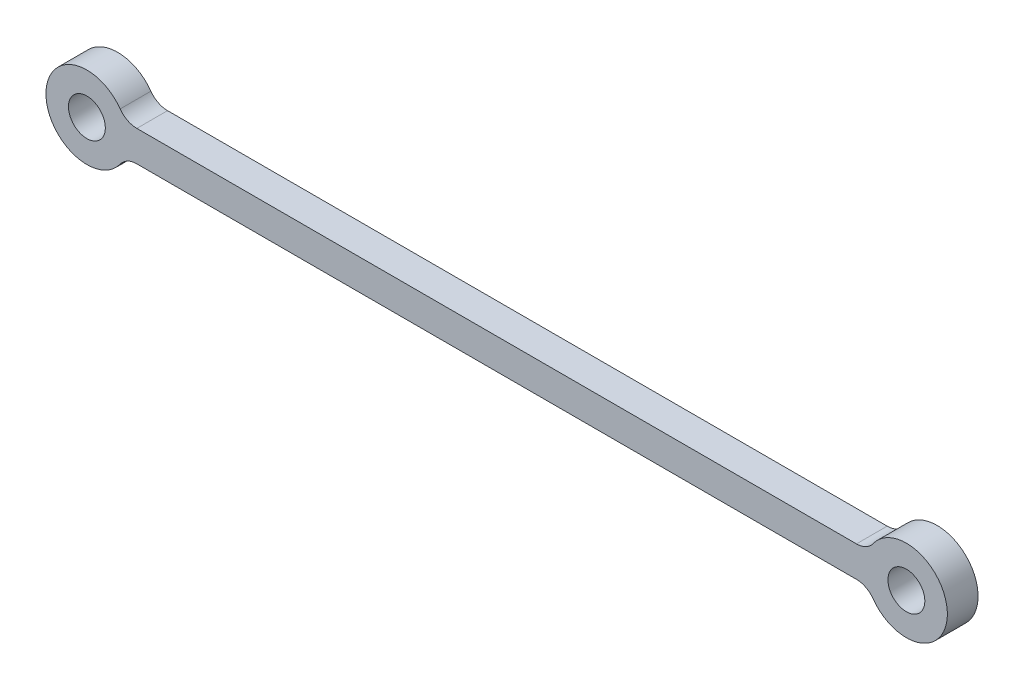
from build123d import *

# Parameters (mm, degrees)
EXTRUDE1_DEPTH       = 30
SKETCH2_R            = 40
EXTRUDE2_DEPTH       = 30
SKETCH3_R            = 18
CUT_EXTRUDE1_DEPTH   = 443.83179651
FILLET1_R            = 20
FILLET1_OF_MIRROR1_R = 20


with BuildPart() as part:
    # Sketch1 → Extrude1 (new body)
    with BuildSketch(Plane.XY):
        with BuildLine():
            Line((-400, 15), (400, 15))
            ThreePointArc((400, 15), (415, 0), (400, -15))
            Line((400, -15), (-400, -15))
            ThreePointArc((-400, -15), (-415, 0), (-400, 15))
        make_face()
    extrude(amount=EXTRUDE1_DEPTH)

    # Sketch2 → Extrude2 (add)
    with BuildSketch(Plane.XY.offset(30)):
        with Locations((-400, 0)):
            Circle(SKETCH2_R)
    extrude2 = extrude(amount=-EXTRUDE2_DEPTH)

    # Sketch3 → Cut-Extrude1 (cut, through all)
    with BuildSketch(Plane.XY.offset(30)):
        with Locations((-400, 0)):
            Circle(SKETCH3_R)
    cut_extrude1 = extrude(amount=-CUT_EXTRUDE1_DEPTH, mode=Mode.SUBTRACT)

    # Fillet1
    fillet1_edges = [part.edges().sort_by_distance(p)[0] for p in [
        (-362.919007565, -15, 15),
        (-362.919007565, 15, 15),
    ]]
    fillet(fillet1_edges, radius=FILLET1_R)

    # Mirror1: Extrude2, Cut-Extrude1 across plane
    add(extrude2.mirror(Plane(origin=(0, 0, 0), x_dir=(0, 0, 1), z_dir=(1, 0, 0))))
    add(cut_extrude1.mirror(Plane(origin=(0, 0, 0), x_dir=(0, 0, 1), z_dir=(1, 0, 0))), mode=Mode.SUBTRACT)

    # Fillet1 of Mirror1
    fillet1_of_mirror1_edges = [part.edges().sort_by_distance(p)[0] for p in [
        (362.919007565, -15, 15),
        (362.919007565, 15, 15),
    ]]
    fillet(fillet1_of_mirror1_edges, radius=FILLET1_OF_MIRROR1_R)


solid = part.part
